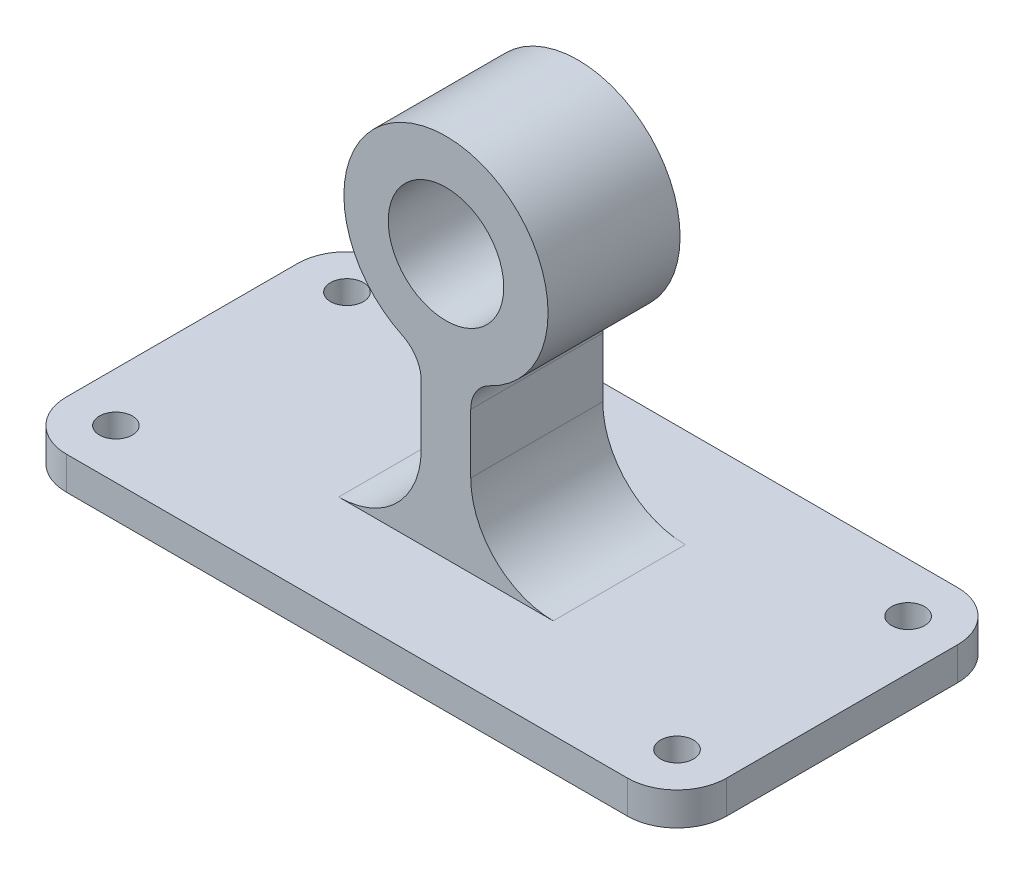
from build123d import *

# Parameters (mm, degrees)
SKETCH2_R           = 5
BOSS_EXTRUDE1_DEPTH = 10
SKETCH3_W           = 15
SKETCH3_H           = 40
BOSS_EXTRUDE2_DEPTH = 50
FILLET1_R           = 25
SKETCH4_R           = 30.923292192
BOSS_EXTRUDE3_DEPTH = 40
FILLET2_R           = 10
SKETCH5_R           = 17.5
CUT_EXTRUDE1_DEPTH  = 40


with BuildPart() as part:
    # Sketch2 → Boss-Extrude1 (new body)
    with BuildSketch(Plane(origin=(0, 0, 0), x_dir=(1, 0, 0), z_dir=(0, 1, 0))):
        with BuildLine():
            Line((15, 0), (185, 0))
            ThreePointArc((185, 0), (195.606601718, 4.393398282), (200, 15))
            Line((200, 15), (200, 85))
            ThreePointArc((200, 85), (195.606601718, 95.606601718), (185, 100))
            Line((185, 100), (15, 100))
            ThreePointArc((15, 100), (4.393398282, 95.606601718), (0, 85))
            Line((0, 85), (0, 15))
            ThreePointArc((0, 15), (4.393398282, 4.393398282), (15, 0))
        make_face()
        with Locations(Location((15, 85, 0), (0, 0, 270))):
            Circle(SKETCH2_R, mode=Mode.SUBTRACT)
        with Locations(Location((15, 15, 0), (0, 0, 270))):
            Circle(SKETCH2_R, mode=Mode.SUBTRACT)
        with Locations(Location((185, 15, 0), (0, 0, 270))):
            Circle(SKETCH2_R, mode=Mode.SUBTRACT)
        with Locations(Location((185, 85, 0), (0, 0, 270))):
            Circle(SKETCH2_R, mode=Mode.SUBTRACT)
    extrude(amount=BOSS_EXTRUDE1_DEPTH)

    # Sketch3 → Boss-Extrude2 (add)
    with BuildSketch(Plane(origin=(0, 10, 0), x_dir=(1, 0, 0), z_dir=(0, 1, 0))):
        with Locations((100, 50)):
            Rectangle(SKETCH3_W, SKETCH3_H)
    extrude(amount=BOSS_EXTRUDE2_DEPTH)

    # Fillet1
    fillet1_edges = [part.edges().sort_by_distance(p)[0] for p in [
        (107.5, 10, -50),
        (92.5, 10, -50),
    ]]
    fillet(fillet1_edges, radius=FILLET1_R)

    # Sketch4 → Boss-Extrude3 (add)
    with BuildSketch(Plane.XY.offset(-30)):
        with Locations((100, 90)):
            Circle(SKETCH4_R)
    extrude(amount=-BOSS_EXTRUDE3_DEPTH)

    # Fillet2
    fillet2_edges = [part.edges().sort_by_distance(p)[0] for p in [
        (107.5, 60, -50),
        (92.5, 60, -50),
    ]]
    fillet(fillet2_edges, radius=FILLET2_R)

    # Sketch5 → Cut-Extrude1 (cut)
    with BuildSketch(Plane.XY.offset(-30)):
        with Locations((100, 90)):
            Circle(SKETCH5_R)
    extrude(amount=-CUT_EXTRUDE1_DEPTH, mode=Mode.SUBTRACT)


solid = part.part
